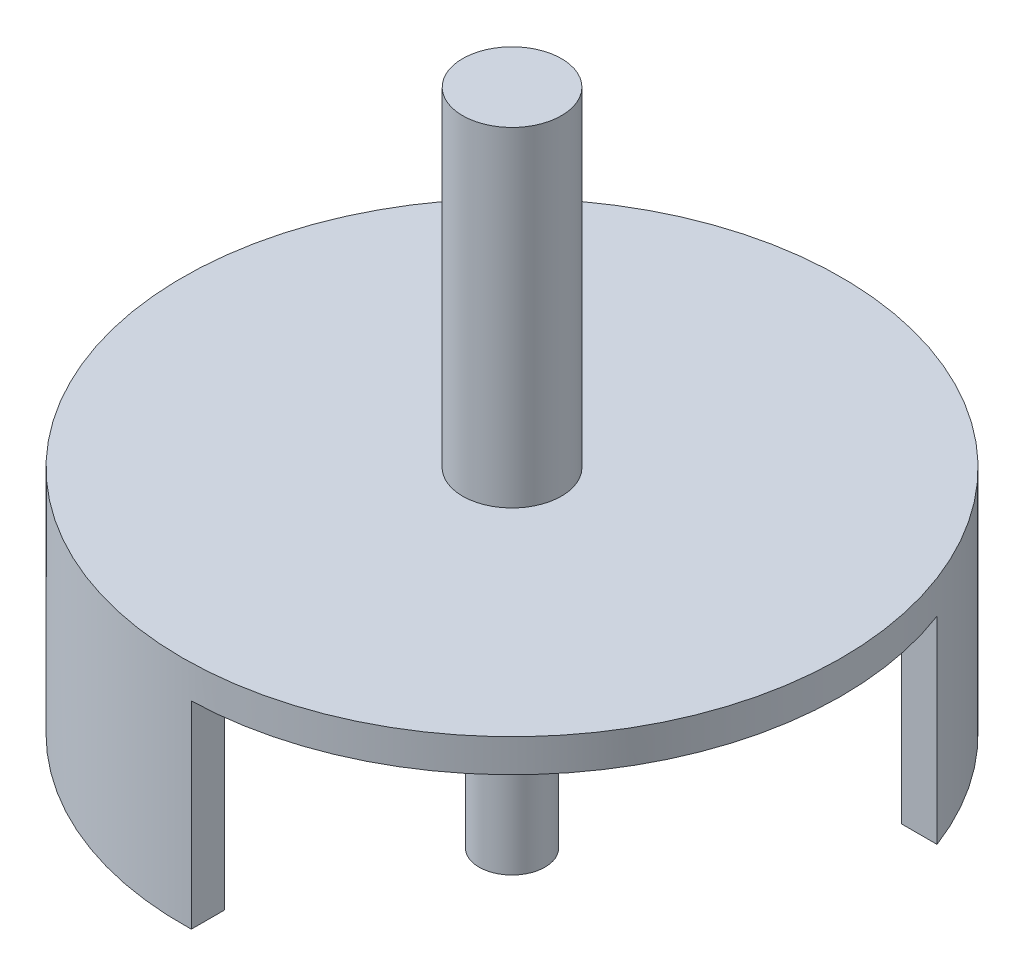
ISO-10303-21;
HEADER;
FILE_DESCRIPTION(('STEP AP214'),'2;1');
FILE_NAME('part.step','',(''),(''),'','','');
FILE_SCHEMA(('AUTOMOTIVE_DESIGN { 1 0 10303 214 1 1 1 1 }'));
ENDSEC;
DATA;
#1=APPLICATION_CONTEXT('core data for automotive mechanical design processes');
#2=APPLICATION_PROTOCOL_DEFINITION('international standard','automotive_design',2000,#1);
#3=PRODUCT_CONTEXT('',#1,'mechanical');
#4=PRODUCT('Part','Part','',(#3));
#5=PRODUCT_RELATED_PRODUCT_CATEGORY('part','',(#4));
#6=PRODUCT_DEFINITION_FORMATION('','',#4);
#7=PRODUCT_DEFINITION_CONTEXT('part definition',#1,'design');
#8=PRODUCT_DEFINITION('design','',#6,#7);
#9=PRODUCT_DEFINITION_SHAPE('','',#8);
#10=(LENGTH_UNIT() NAMED_UNIT(*) SI_UNIT(.MILLI.,.METRE.));
#11=(NAMED_UNIT(*) PLANE_ANGLE_UNIT() SI_UNIT($,.RADIAN.));
#12=(NAMED_UNIT(*) SI_UNIT($,.STERADIAN.) SOLID_ANGLE_UNIT());
#13=UNCERTAINTY_MEASURE_WITH_UNIT(LENGTH_MEASURE(1.E-05),#10,'distance_accuracy_value','');
#14=(GEOMETRIC_REPRESENTATION_CONTEXT(3) GLOBAL_UNCERTAINTY_ASSIGNED_CONTEXT((#13)) GLOBAL_UNIT_ASSIGNED_CONTEXT((#10,
#11,#12)) REPRESENTATION_CONTEXT('',''));
#15=CARTESIAN_POINT('',(0.,0.,0.));
#16=DIRECTION('',(0.,0.,1.));
#17=DIRECTION('',(1.,0.,0.));
#18=AXIS2_PLACEMENT_3D('',#15,#16,#17);
#19=CARTESIAN_POINT('',(0.,7.,0.));
#20=DIRECTION('',(0.,1.,0.));
#21=DIRECTION('',(0.,0.,1.));
#22=AXIS2_PLACEMENT_3D('',#19,#20,#21);
#23=PLANE('',#22);
#24=CARTESIAN_POINT('',(0.,7.,0.));
#25=DIRECTION('',(0.,1.,0.));
#26=DIRECTION('',(0.,0.,1.));
#27=AXIS2_PLACEMENT_3D('',#24,#25,#26);
#28=CIRCLE('',#27,10.);
#29=CARTESIAN_POINT('',(0.,7.,10.));
#30=VERTEX_POINT('',#29);
#31=EDGE_CURVE('E40',#30,#30,#28,.T.);
#32=ORIENTED_EDGE('',*,*,#31,.T.);
#33=EDGE_LOOP('',(#32));
#34=FACE_BOUND('',#33,.T.);
#35=CARTESIAN_POINT('',(0.,7.,0.));
#36=DIRECTION('',(0.,1.,0.));
#37=DIRECTION('',(0.,0.,1.));
#38=AXIS2_PLACEMENT_3D('',#35,#36,#37);
#39=CIRCLE('',#38,1.5);
#40=CARTESIAN_POINT('',(0.,7.,1.5));
#41=VERTEX_POINT('',#40);
#42=EDGE_CURVE('E110',#41,#41,#39,.T.);
#43=ORIENTED_EDGE('',*,*,#42,.F.);
#44=EDGE_LOOP('',(#43));
#45=FACE_BOUND('',#44,.T.);
#46=ADVANCED_FACE('F32',(#34,#45),#23,.T.);
#47=CARTESIAN_POINT('',(0.,7.,0.));
#48=DIRECTION('',(0.,-1.,0.));
#49=DIRECTION('',(0.,0.,-1.));
#50=AXIS2_PLACEMENT_3D('',#47,#48,#49);
#51=CYLINDRICAL_SURFACE('',#50,10.);
#52=ORIENTED_EDGE('',*,*,#31,.F.);
#53=EDGE_LOOP('',(#52));
#54=FACE_BOUND('',#53,.T.);
#55=CARTESIAN_POINT('',(0.,6.,0.));
#56=DIRECTION('',(0.,-1.,0.));
#57=DIRECTION('',(0.,0.,-1.));
#58=AXIS2_PLACEMENT_3D('',#55,#56,#57);
#59=CIRCLE('',#58,10.);
#60=CARTESIAN_POINT('',(9.34981554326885,6.,-3.546963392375));
#61=VERTEX_POINT('',#60);
#62=CARTESIAN_POINT('',(0.263823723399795,6.,9.99651924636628));
#63=VERTEX_POINT('',#62);
#64=EDGE_CURVE('E95',#61,#63,#59,.T.);
#65=ORIENTED_EDGE('',*,*,#64,.F.);
#66=DIRECTION('',(0.,-1.,0.));
#67=VECTOR('',#66,1.);
#68=CARTESIAN_POINT('',(9.34981554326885,7.,-3.546963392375));
#69=LINE('',#68,#67);
#70=CARTESIAN_POINT('',(9.34981554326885,0.,-3.546963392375));
#71=VERTEX_POINT('',#70);
#72=EDGE_CURVE('E85',#61,#71,#69,.T.);
#73=ORIENTED_EDGE('',*,*,#72,.T.);
#74=CARTESIAN_POINT('',(0.,0.,0.));
#75=DIRECTION('',(0.,1.,0.));
#76=DIRECTION('',(0.,0.,1.));
#77=AXIS2_PLACEMENT_3D('',#74,#75,#76);
#78=CIRCLE('',#77,10.);
#79=CARTESIAN_POINT('',(0.263823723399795,0.,9.99651924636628));
#80=VERTEX_POINT('',#79);
#81=EDGE_CURVE('E47',#71,#80,#78,.T.);
#82=ORIENTED_EDGE('',*,*,#81,.T.);
#83=DIRECTION('',(0.,-1.,0.));
#84=VECTOR('',#83,1.);
#85=CARTESIAN_POINT('',(0.263823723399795,7.,9.99651924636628));
#86=LINE('',#85,#84);
#87=EDGE_CURVE('E98',#80,#63,#86,.F.);
#88=ORIENTED_EDGE('',*,*,#87,.T.);
#89=EDGE_LOOP('',(#65,#73,#82,#88));
#90=FACE_BOUND('',#89,.T.);
#91=ADVANCED_FACE('F34',(#54,#90),#51,.T.);
#92=CARTESIAN_POINT('',(0.,0.,0.));
#93=DIRECTION('',(0.,1.,0.));
#94=DIRECTION('',(0.,0.,1.));
#95=AXIS2_PLACEMENT_3D('',#92,#93,#94);
#96=PLANE('',#95);
#97=ORIENTED_EDGE('',*,*,#81,.F.);
#98=DIRECTION('',(1.,0.,0.));
#99=VECTOR('',#98,1.);
#100=CARTESIAN_POINT('',(7.82677046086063,0.,-3.546963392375));
#101=LINE('',#100,#99);
#102=CARTESIAN_POINT('',(8.27158090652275,0.,-3.546963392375));
#103=VERTEX_POINT('',#102);
#104=EDGE_CURVE('E78',#103,#71,#101,.T.);
#105=ORIENTED_EDGE('',*,*,#104,.F.);
#106=CARTESIAN_POINT('',(0.,0.,0.));
#107=DIRECTION('',(0.,-1.,0.));
#108=DIRECTION('',(0.,0.,-1.));
#109=AXIS2_PLACEMENT_3D('',#106,#107,#108);
#110=CIRCLE('',#109,9.);
#111=CARTESIAN_POINT('',(0.263823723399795,0.,8.99613233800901));
#112=VERTEX_POINT('',#111);
#113=EDGE_CURVE('E90',#112,#103,#110,.T.);
#114=ORIENTED_EDGE('',*,*,#113,.F.);
#115=DIRECTION('',(0.,0.,1.));
#116=VECTOR('',#115,1.);
#117=CARTESIAN_POINT('',(0.263823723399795,0.,0.322451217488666));
#118=LINE('',#117,#116);
#119=EDGE_CURVE('E54',#112,#80,#118,.T.);
#120=ORIENTED_EDGE('',*,*,#119,.T.);
#121=EDGE_LOOP('',(#97,#105,#114,#120));
#122=FACE_BOUND('',#121,.T.);
#123=ADVANCED_FACE('F89',(#122),#96,.F.);
#124=CARTESIAN_POINT('',(0.,6.,0.));
#125=DIRECTION('',(0.,-1.,0.));
#126=DIRECTION('',(0.,0.,-1.));
#127=AXIS2_PLACEMENT_3D('',#124,#125,#126);
#128=CYLINDRICAL_SURFACE('',#127,9.);
#129=ORIENTED_EDGE('',*,*,#113,.T.);
#130=DIRECTION('',(0.,-1.,0.));
#131=VECTOR('',#130,1.);
#132=CARTESIAN_POINT('',(8.27158090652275,6.,-3.546963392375));
#133=LINE('',#132,#131);
#134=CARTESIAN_POINT('',(8.27158090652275,6.,-3.546963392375));
#135=VERTEX_POINT('',#134);
#136=EDGE_CURVE('E74',#103,#135,#133,.F.);
#137=ORIENTED_EDGE('',*,*,#136,.T.);
#138=CARTESIAN_POINT('',(0.,6.,0.));
#139=DIRECTION('',(0.,-1.,0.));
#140=DIRECTION('',(0.,0.,-1.));
#141=AXIS2_PLACEMENT_3D('',#138,#139,#140);
#142=CIRCLE('',#141,9.);
#143=CARTESIAN_POINT('',(0.263823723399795,6.,8.99613233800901));
#144=VERTEX_POINT('',#143);
#145=EDGE_CURVE('E94',#144,#135,#142,.T.);
#146=ORIENTED_EDGE('',*,*,#145,.F.);
#147=DIRECTION('',(0.,-1.,0.));
#148=VECTOR('',#147,1.);
#149=CARTESIAN_POINT('',(0.263823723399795,6.,8.99613233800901));
#150=LINE('',#149,#148);
#151=EDGE_CURVE('E93',#144,#112,#150,.T.);
#152=ORIENTED_EDGE('',*,*,#151,.T.);
#153=EDGE_LOOP('',(#129,#137,#146,#152));
#154=FACE_BOUND('',#153,.T.);
#155=ADVANCED_FACE('F92',(#154),#128,.F.);
#156=CARTESIAN_POINT('',(0.,6.,0.));
#157=DIRECTION('',(0.,-1.,0.));
#158=DIRECTION('',(0.,0.,-1.));
#159=AXIS2_PLACEMENT_3D('',#156,#157,#158);
#160=PLANE('',#159);
#161=ORIENTED_EDGE('',*,*,#145,.T.);
#162=DIRECTION('',(1.,0.,0.));
#163=VECTOR('',#162,1.);
#164=CARTESIAN_POINT('',(7.82677046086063,6.,-3.546963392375));
#165=LINE('',#164,#163);
#166=EDGE_CURVE('E80',#135,#61,#165,.T.);
#167=ORIENTED_EDGE('',*,*,#166,.T.);
#168=ORIENTED_EDGE('',*,*,#64,.T.);
#169=DIRECTION('',(0.,0.,1.));
#170=VECTOR('',#169,1.);
#171=CARTESIAN_POINT('',(0.263823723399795,6.,0.322451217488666));
#172=LINE('',#171,#170);
#173=EDGE_CURVE('E124',#144,#63,#172,.T.);
#174=ORIENTED_EDGE('',*,*,#173,.F.);
#175=EDGE_LOOP('',(#161,#167,#168,#174));
#176=FACE_BOUND('',#175,.T.);
#177=CARTESIAN_POINT('',(0.,6.,0.));
#178=DIRECTION('',(0.,-1.,0.));
#179=DIRECTION('',(0.,0.,-1.));
#180=AXIS2_PLACEMENT_3D('',#177,#178,#179);
#181=CIRCLE('',#180,1.);
#182=CARTESIAN_POINT('',(0.,6.,-1.));
#183=VERTEX_POINT('',#182);
#184=EDGE_CURVE('E12',#183,#183,#181,.T.);
#185=ORIENTED_EDGE('',*,*,#184,.F.);
#186=EDGE_LOOP('',(#185));
#187=FACE_BOUND('',#186,.T.);
#188=ADVANCED_FACE('F112',(#176,#187),#160,.T.);
#189=CARTESIAN_POINT('',(0.263823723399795,0.,0.322451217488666));
#190=DIRECTION('',(-1.,0.,0.));
#191=DIRECTION('',(0.,0.,1.));
#192=AXIS2_PLACEMENT_3D('',#189,#190,#191);
#193=PLANE('',#192);
#194=ORIENTED_EDGE('',*,*,#119,.F.);
#195=ORIENTED_EDGE('',*,*,#151,.F.);
#196=ORIENTED_EDGE('',*,*,#173,.T.);
#197=ORIENTED_EDGE('',*,*,#87,.F.);
#198=EDGE_LOOP('',(#194,#195,#196,#197));
#199=FACE_BOUND('',#198,.T.);
#200=ADVANCED_FACE('F132',(#199),#193,.F.);
#201=CARTESIAN_POINT('',(0.,-3.,0.));
#202=DIRECTION('',(0.,1.,0.));
#203=DIRECTION('',(0.,0.,1.));
#204=AXIS2_PLACEMENT_3D('',#201,#202,#203);
#205=CYLINDRICAL_SURFACE('',#204,1.);
#206=ORIENTED_EDGE('',*,*,#184,.T.);
#207=EDGE_LOOP('',(#206));
#208=FACE_BOUND('',#207,.T.);
#209=CARTESIAN_POINT('',(0.,-3.,0.));
#210=DIRECTION('',(0.,1.,0.));
#211=DIRECTION('',(0.,0.,1.));
#212=AXIS2_PLACEMENT_3D('',#209,#210,#211);
#213=CIRCLE('',#212,1.);
#214=CARTESIAN_POINT('',(0.,-3.,1.));
#215=VERTEX_POINT('',#214);
#216=EDGE_CURVE('E119',#215,#215,#213,.T.);
#217=ORIENTED_EDGE('',*,*,#216,.T.);
#218=EDGE_LOOP('',(#217));
#219=FACE_BOUND('',#218,.T.);
#220=ADVANCED_FACE('F134',(#208,#219),#205,.T.);
#221=CARTESIAN_POINT('',(0.,-3.,0.));
#222=DIRECTION('',(0.,1.,0.));
#223=DIRECTION('',(0.,0.,1.));
#224=AXIS2_PLACEMENT_3D('',#221,#222,#223);
#225=PLANE('',#224);
#226=ORIENTED_EDGE('',*,*,#216,.F.);
#227=EDGE_LOOP('',(#226));
#228=FACE_BOUND('',#227,.T.);
#229=ADVANCED_FACE('F140',(#228),#225,.F.);
#230=CARTESIAN_POINT('',(0.,17.,0.));
#231=DIRECTION('',(0.,-1.,0.));
#232=DIRECTION('',(0.,0.,-1.));
#233=AXIS2_PLACEMENT_3D('',#230,#231,#232);
#234=CYLINDRICAL_SURFACE('',#233,1.5);
#235=CARTESIAN_POINT('',(0.,17.,0.));
#236=DIRECTION('',(0.,1.,0.));
#237=DIRECTION('',(0.,0.,1.));
#238=AXIS2_PLACEMENT_3D('',#235,#236,#237);
#239=CIRCLE('',#238,1.5);
#240=CARTESIAN_POINT('',(0.,17.,1.5));
#241=VERTEX_POINT('',#240);
#242=EDGE_CURVE('E116',#241,#241,#239,.T.);
#243=ORIENTED_EDGE('',*,*,#242,.F.);
#244=EDGE_LOOP('',(#243));
#245=FACE_BOUND('',#244,.T.);
#246=ORIENTED_EDGE('',*,*,#42,.T.);
#247=EDGE_LOOP('',(#246));
#248=FACE_BOUND('',#247,.T.);
#249=ADVANCED_FACE('F178',(#245,#248),#234,.T.);
#250=CARTESIAN_POINT('',(0.,17.,0.));
#251=DIRECTION('',(0.,1.,0.));
#252=DIRECTION('',(0.,0.,1.));
#253=AXIS2_PLACEMENT_3D('',#250,#251,#252);
#254=PLANE('',#253);
#255=ORIENTED_EDGE('',*,*,#242,.T.);
#256=EDGE_LOOP('',(#255));
#257=FACE_BOUND('',#256,.T.);
#258=ADVANCED_FACE('F169',(#257),#254,.T.);
#259=CARTESIAN_POINT('',(7.82677046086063,6.,-3.546963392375));
#260=DIRECTION('',(0.,0.,-1.));
#261=DIRECTION('',(-1.,0.,0.));
#262=AXIS2_PLACEMENT_3D('',#259,#260,#261);
#263=PLANE('',#262);
#264=ORIENTED_EDGE('',*,*,#166,.F.);
#265=ORIENTED_EDGE('',*,*,#136,.F.);
#266=ORIENTED_EDGE('',*,*,#104,.T.);
#267=ORIENTED_EDGE('',*,*,#72,.F.);
#268=EDGE_LOOP('',(#264,#265,#266,#267));
#269=FACE_BOUND('',#268,.T.);
#270=ADVANCED_FACE('F76',(#269),#263,.F.);
#271=CLOSED_SHELL('',(#46,#91,#123,#155,#188,#200,#220,#229,#249,#258,#270));
#272=MANIFOLD_SOLID_BREP('B2',#271);
#273=ADVANCED_BREP_SHAPE_REPRESENTATION('',(#18,#272),#14);
#274=SHAPE_DEFINITION_REPRESENTATION(#9,#273);
ENDSEC;
END-ISO-10303-21;
